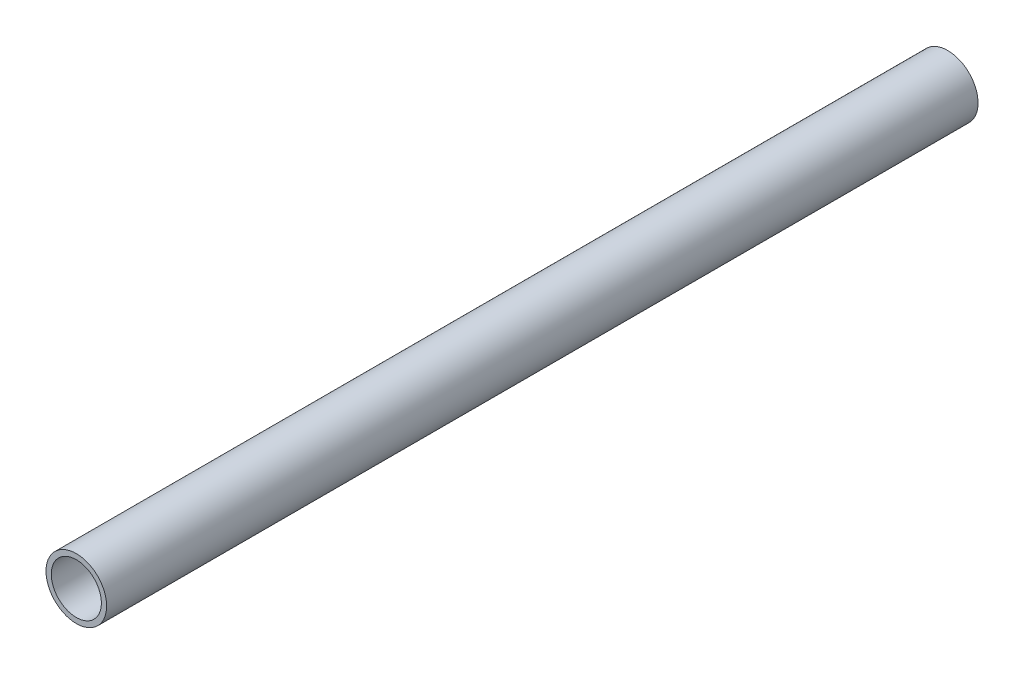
from build123d import *

# Parameters (mm, degrees)
SKETCH1_R          = 21.209
SKETCH1_R_2        = 17.526
BASE_EXTRUDE_DEPTH = 304.8


with BuildPart() as part:
    # Sketch1 → Base-Extrude (new, symmetric)
    with BuildSketch(Plane.XY):
        with Locations(Location((0, 0, 0), (0, 0, 180))):
            Circle(SKETCH1_R)
        with Locations(Location((0, 0, 0), (0, 0, 180))):
            Circle(SKETCH1_R_2, mode=Mode.SUBTRACT)
    extrude(amount=BASE_EXTRUDE_DEPTH, both=True)


solid = part.part
